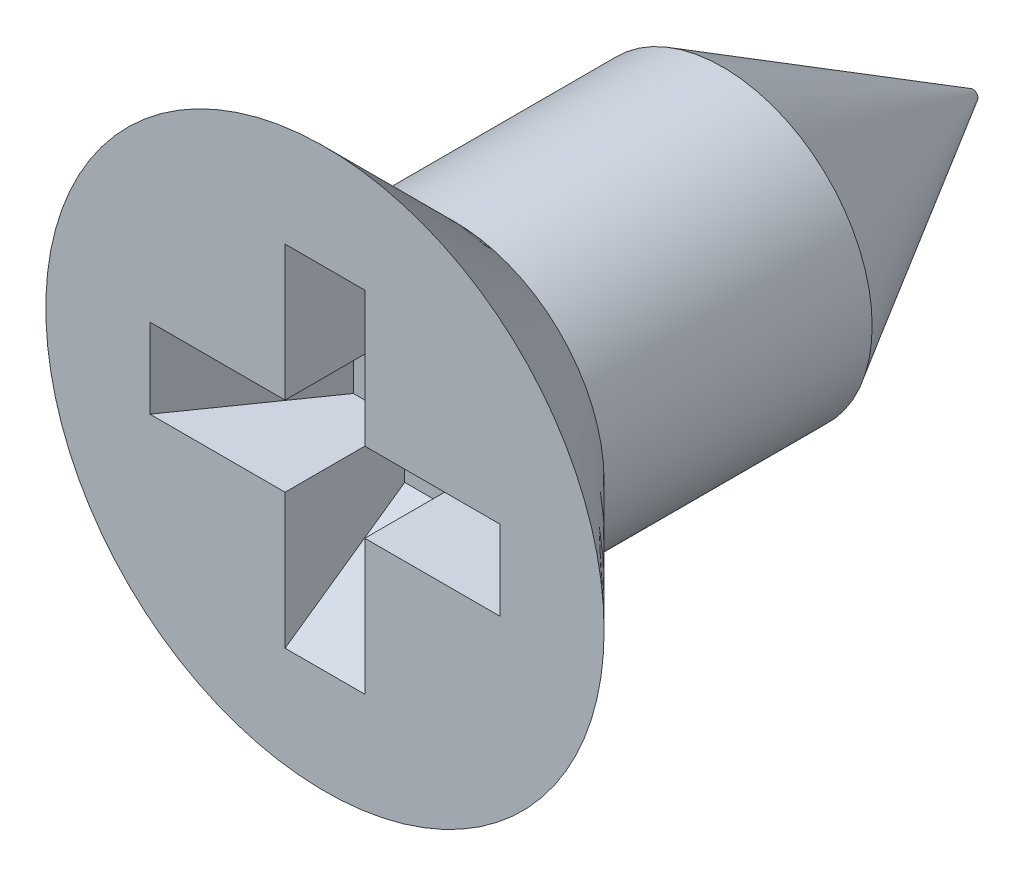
ISO-10303-21;
HEADER;
FILE_DESCRIPTION(('STEP AP214'),'2;1');
FILE_NAME('part.step','',(''),(''),'','','');
FILE_SCHEMA(('AUTOMOTIVE_DESIGN { 1 0 10303 214 1 1 1 1 }'));
ENDSEC;
DATA;
#1=APPLICATION_CONTEXT('core data for automotive mechanical design processes');
#2=APPLICATION_PROTOCOL_DEFINITION('international standard','automotive_design',2000,#1);
#3=PRODUCT_CONTEXT('',#1,'mechanical');
#4=PRODUCT('Part','Part','',(#3));
#5=PRODUCT_RELATED_PRODUCT_CATEGORY('part','',(#4));
#6=PRODUCT_DEFINITION_FORMATION('','',#4);
#7=PRODUCT_DEFINITION_CONTEXT('part definition',#1,'design');
#8=PRODUCT_DEFINITION('design','',#6,#7);
#9=PRODUCT_DEFINITION_SHAPE('','',#8);
#10=(LENGTH_UNIT() NAMED_UNIT(*) SI_UNIT(.MILLI.,.METRE.));
#11=(NAMED_UNIT(*) PLANE_ANGLE_UNIT() SI_UNIT($,.RADIAN.));
#12=(NAMED_UNIT(*) SI_UNIT($,.STERADIAN.) SOLID_ANGLE_UNIT());
#13=UNCERTAINTY_MEASURE_WITH_UNIT(LENGTH_MEASURE(1.E-05),#10,'distance_accuracy_value','');
#14=(GEOMETRIC_REPRESENTATION_CONTEXT(3) GLOBAL_UNCERTAINTY_ASSIGNED_CONTEXT((#13)) GLOBAL_UNIT_ASSIGNED_CONTEXT((#10,
#11,#12)) REPRESENTATION_CONTEXT('',''));
#15=CARTESIAN_POINT('',(0.,0.,0.));
#16=DIRECTION('',(0.,0.,1.));
#17=DIRECTION('',(1.,0.,0.));
#18=AXIS2_PLACEMENT_3D('',#15,#16,#17);
#19=CARTESIAN_POINT('',(-1.75499287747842,-0.4,0.));
#20=DIRECTION('',(0.819152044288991,0.,0.573576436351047));
#21=DIRECTION('',(0.573576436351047,0.,-0.819152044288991));
#22=AXIS2_PLACEMENT_3D('',#19,#20,#21);
#23=PLANE('',#22);
#24=DIRECTION('',(0.,1.,0.));
#25=VECTOR('',#24,1.);
#26=CARTESIAN_POINT('',(0.,0.4,-2.50638957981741));
#27=LINE('',#26,#25);
#28=CARTESIAN_POINT('',(0.,-0.29361042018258,-2.50638957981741));
#29=VERTEX_POINT('',#28);
#30=CARTESIAN_POINT('',(0.,0.,-2.50638957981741));
#31=VERTEX_POINT('',#30);
#32=EDGE_CURVE('E353',#29,#31,#27,.T.);
#33=ORIENTED_EDGE('',*,*,#32,.F.);
#34=CARTESIAN_POINT('',(0.103438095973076,-0.102874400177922,-2.65411449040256));
#35=CARTESIAN_POINT('',(0.09992365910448,-0.113485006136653,-2.64909535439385));
#36=CARTESIAN_POINT('',(0.096077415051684,-0.123726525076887,-2.64360234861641));
#37=CARTESIAN_POINT('',(0.0878958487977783,-0.143557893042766,-2.63191786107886));
#38=CARTESIAN_POINT('',(0.0835619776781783,-0.153149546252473,-2.62572845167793));
#39=CARTESIAN_POINT('',(0.0745900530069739,-0.171760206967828,-2.61291521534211));
#40=CARTESIAN_POINT('',(0.0699544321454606,-0.180782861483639,-2.60629486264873));
#41=CARTESIAN_POINT('',(0.0604348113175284,-0.198432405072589,-2.59269943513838));
#42=CARTESIAN_POINT('',(0.0555506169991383,-0.207058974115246,-2.58572408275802));
#43=CARTESIAN_POINT('',(0.0425194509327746,-0.229237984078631,-2.56711364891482));
#44=CARTESIAN_POINT('',(0.0342270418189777,-0.242528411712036,-2.55527086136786));
#45=CARTESIAN_POINT('',(0.0172728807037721,-0.268554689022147,-2.5310578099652));
#46=CARTESIAN_POINT('',(0.00860925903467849,-0.28128685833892,-2.51868487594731));
#47=CARTESIAN_POINT('',(-0.000140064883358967,-0.2938104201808,-2.50618954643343));
#48=B_SPLINE_CURVE_WITH_KNOTS('',3,(#34,#35,#36,#37,#38,#39,#40,#41,#42,#43,#44,#45,#46,#47),
.UNSPECIFIED.,.F.,.F.,(4,2,2,2,2,2,4),(0.,0.036695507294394,0.0732845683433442,
0.109608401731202,0.145961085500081,0.204852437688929,0.264086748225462),.UNSPECIFIED.);
#49=CARTESIAN_POINT('',(0.103298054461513,-0.103298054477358,-2.65391449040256));
#50=VERTEX_POINT('',#49);
#51=EDGE_CURVE('E288',#50,#29,#48,.T.);
#52=ORIENTED_EDGE('',*,*,#51,.F.);
#53=DIRECTION('',(-0.497542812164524,0.497542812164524,0.710564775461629));
#54=VECTOR('',#53,1.);
#55=CARTESIAN_POINT('',(-1.41956594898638,1.41956594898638,-0.479039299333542));
#56=LINE('',#55,#54);
#57=EDGE_CURVE('E351',#50,#31,#56,.T.);
#58=ORIENTED_EDGE('',*,*,#57,.T.);
#59=EDGE_LOOP('',(#33,#52,#58));
#60=FACE_BOUND('',#59,.T.);
#61=ADVANCED_FACE('F26',(#60),#23,.T.);
#62=DIRECTION('',(0.,1.,0.));
#63=VECTOR('',#62,1.);
#64=CARTESIAN_POINT('',(-0.91474383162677,-0.4,-1.2));
#65=LINE('',#64,#63);
#66=CARTESIAN_POINT('',(-0.91474383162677,0.4,-1.2));
#67=VERTEX_POINT('',#66);
#68=CARTESIAN_POINT('',(-0.91474383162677,-0.4,-1.2));
#69=VERTEX_POINT('',#68);
#70=EDGE_CURVE('E347',#67,#69,#65,.F.);
#71=ORIENTED_EDGE('',*,*,#70,.F.);
#72=DIRECTION('',(0.573576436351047,0.,-0.819152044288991));
#73=VECTOR('',#72,1.);
#74=CARTESIAN_POINT('',(-1.19117730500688,0.4,-0.8052120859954));
#75=LINE('',#74,#73);
#76=CARTESIAN_POINT('',(-1.75499287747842,0.4,0.));
#77=VERTEX_POINT('',#76);
#78=EDGE_CURVE('E231',#67,#77,#75,.F.);
#79=ORIENTED_EDGE('',*,*,#78,.T.);
#80=DIRECTION('',(0.,-1.,0.));
#81=VECTOR('',#80,1.);
#82=CARTESIAN_POINT('',(-1.75499287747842,-0.4,0.));
#83=LINE('',#82,#81);
#84=CARTESIAN_POINT('',(-1.75499287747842,-0.4,0.));
#85=VERTEX_POINT('',#84);
#86=EDGE_CURVE('E172',#77,#85,#83,.T.);
#87=ORIENTED_EDGE('',*,*,#86,.T.);
#88=DIRECTION('',(0.573576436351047,0.,-0.819152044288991));
#89=VECTOR('',#88,1.);
#90=CARTESIAN_POINT('',(-1.75499287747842,-0.4,0.));
#91=LINE('',#90,#89);
#92=EDGE_CURVE('E163',#69,#85,#91,.F.);
#93=ORIENTED_EDGE('',*,*,#92,.F.);
#94=EDGE_LOOP('',(#71,#79,#87,#93));
#95=FACE_BOUND('',#94,.T.);
#96=ADVANCED_FACE('F282',(#95),#23,.T.);
#97=CARTESIAN_POINT('',(0.4,-1.75499287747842,0.));
#98=DIRECTION('',(0.,0.819152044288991,0.573576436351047));
#99=DIRECTION('',(0.,-0.573576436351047,0.819152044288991));
#100=AXIS2_PLACEMENT_3D('',#97,#98,#99);
#101=PLANE('',#100);
#102=DIRECTION('',(-1.,0.,0.));
#103=VECTOR('',#102,1.);
#104=CARTESIAN_POINT('',(0.4,-0.91474383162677,-1.2));
#105=LINE('',#104,#103);
#106=CARTESIAN_POINT('',(-0.4,-0.91474383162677,-1.2));
#107=VERTEX_POINT('',#106);
#108=CARTESIAN_POINT('',(0.4,-0.91474383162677,-1.2));
#109=VERTEX_POINT('',#108);
#110=EDGE_CURVE('E345',#107,#109,#105,.F.);
#111=ORIENTED_EDGE('',*,*,#110,.F.);
#112=DIRECTION('',(0.,0.573576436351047,-0.819152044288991));
#113=VECTOR('',#112,1.);
#114=CARTESIAN_POINT('',(-0.4,-0.74539829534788,-1.44185049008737));
#115=LINE('',#114,#113);
#116=CARTESIAN_POINT('',(-0.4,-1.75499287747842,0.));
#117=VERTEX_POINT('',#116);
#118=EDGE_CURVE('E162',#107,#117,#115,.F.);
#119=ORIENTED_EDGE('',*,*,#118,.T.);
#120=DIRECTION('',(1.,0.,0.));
#121=VECTOR('',#120,1.);
#122=CARTESIAN_POINT('',(0.4,-1.75499287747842,0.));
#123=LINE('',#122,#121);
#124=CARTESIAN_POINT('',(0.4,-1.75499287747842,0.));
#125=VERTEX_POINT('',#124);
#126=EDGE_CURVE('E178',#117,#125,#123,.T.);
#127=ORIENTED_EDGE('',*,*,#126,.T.);
#128=DIRECTION('',(0.,0.573576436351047,-0.819152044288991));
#129=VECTOR('',#128,1.);
#130=CARTESIAN_POINT('',(0.4,-1.75499287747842,0.));
#131=LINE('',#130,#129);
#132=EDGE_CURVE('E239',#109,#125,#131,.F.);
#133=ORIENTED_EDGE('',*,*,#132,.F.);
#134=EDGE_LOOP('',(#111,#119,#127,#133));
#135=FACE_BOUND('',#134,.T.);
#136=ADVANCED_FACE('F278',(#135),#101,.T.);
#137=CARTESIAN_POINT('',(-1.75499287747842,1.75499287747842,-1.2));
#138=DIRECTION('',(0.,0.,-1.));
#139=DIRECTION('',(-1.,0.,0.));
#140=AXIS2_PLACEMENT_3D('',#137,#138,#139);
#141=PLANE('',#140);
#142=DIRECTION('',(0.,-1.,0.));
#143=VECTOR('',#142,1.);
#144=CARTESIAN_POINT('',(-0.4,1.75499287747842,-1.2));
#145=LINE('',#144,#143);
#146=CARTESIAN_POINT('',(-0.4,1.54919333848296,-1.2));
#147=VERTEX_POINT('',#146);
#148=CARTESIAN_POINT('',(-0.4,0.91474383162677,-1.2));
#149=VERTEX_POINT('',#148);
#150=EDGE_CURVE('E222',#147,#149,#145,.T.);
#151=ORIENTED_EDGE('',*,*,#150,.T.);
#152=CARTESIAN_POINT('',(-0.4,0.4,-1.2));
#153=VERTEX_POINT('',#152);
#154=EDGE_CURVE('E223',#149,#153,#145,.T.);
#155=ORIENTED_EDGE('',*,*,#154,.T.);
#156=DIRECTION('',(-1.,0.,0.));
#157=VECTOR('',#156,1.);
#158=CARTESIAN_POINT('',(-1.75499287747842,0.4,-1.2));
#159=LINE('',#158,#157);
#160=EDGE_CURVE('E226',#153,#67,#159,.T.);
#161=ORIENTED_EDGE('',*,*,#160,.T.);
#162=ORIENTED_EDGE('',*,*,#70,.T.);
#163=DIRECTION('',(1.,0.,0.));
#164=VECTOR('',#163,1.);
#165=CARTESIAN_POINT('',(-1.75499287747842,-0.4,-1.2));
#166=LINE('',#165,#164);
#167=CARTESIAN_POINT('',(-0.4,-0.4,-1.2));
#168=VERTEX_POINT('',#167);
#169=EDGE_CURVE('E207',#69,#168,#166,.T.);
#170=ORIENTED_EDGE('',*,*,#169,.T.);
#171=DIRECTION('',(0.,-1.,0.));
#172=VECTOR('',#171,1.);
#173=CARTESIAN_POINT('',(-0.4,-0.4,-1.2));
#174=LINE('',#173,#172);
#175=EDGE_CURVE('E158',#168,#107,#174,.T.);
#176=ORIENTED_EDGE('',*,*,#175,.T.);
#177=ORIENTED_EDGE('',*,*,#110,.T.);
#178=DIRECTION('',(0.,1.,0.));
#179=VECTOR('',#178,1.);
#180=CARTESIAN_POINT('',(0.4,-0.4,-1.2));
#181=LINE('',#180,#179);
#182=CARTESIAN_POINT('',(0.4,-0.4,-1.2));
#183=VERTEX_POINT('',#182);
#184=EDGE_CURVE('E210',#109,#183,#181,.T.);
#185=ORIENTED_EDGE('',*,*,#184,.T.);
#186=DIRECTION('',(1.,0.,0.));
#187=VECTOR('',#186,1.);
#188=CARTESIAN_POINT('',(0.4,-0.4,-1.2));
#189=LINE('',#188,#187);
#190=CARTESIAN_POINT('',(0.91474383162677,-0.4,-1.2));
#191=VERTEX_POINT('',#190);
#192=EDGE_CURVE('E213',#183,#191,#189,.T.);
#193=ORIENTED_EDGE('',*,*,#192,.T.);
#194=DIRECTION('',(0.,-1.,0.));
#195=VECTOR('',#194,1.);
#196=CARTESIAN_POINT('',(0.91474383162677,0.4,-1.2));
#197=LINE('',#196,#195);
#198=CARTESIAN_POINT('',(0.91474383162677,0.4,-1.2));
#199=VERTEX_POINT('',#198);
#200=EDGE_CURVE('E338',#191,#199,#197,.F.);
#201=ORIENTED_EDGE('',*,*,#200,.T.);
#202=DIRECTION('',(-1.,0.,0.));
#203=VECTOR('',#202,1.);
#204=CARTESIAN_POINT('',(0.4,0.4,-1.2));
#205=LINE('',#204,#203);
#206=CARTESIAN_POINT('',(0.4,0.4,-1.2));
#207=VERTEX_POINT('',#206);
#208=EDGE_CURVE('E216',#199,#207,#205,.T.);
#209=ORIENTED_EDGE('',*,*,#208,.T.);
#210=DIRECTION('',(0.,1.,0.));
#211=VECTOR('',#210,1.);
#212=CARTESIAN_POINT('',(0.4,1.75499287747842,-1.2));
#213=LINE('',#212,#211);
#214=CARTESIAN_POINT('',(0.4,0.91474383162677,-1.2));
#215=VERTEX_POINT('',#214);
#216=EDGE_CURVE('E219',#207,#215,#213,.T.);
#217=ORIENTED_EDGE('',*,*,#216,.T.);
#218=CARTESIAN_POINT('',(0.4,1.54919333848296,-1.2));
#219=VERTEX_POINT('',#218);
#220=EDGE_CURVE('E220',#215,#219,#213,.T.);
#221=ORIENTED_EDGE('',*,*,#220,.T.);
#222=CARTESIAN_POINT('',(0.,0.,-1.2));
#223=DIRECTION('',(0.,0.,-1.));
#224=DIRECTION('',(-1.,0.,0.));
#225=AXIS2_PLACEMENT_3D('',#222,#223,#224);
#226=CIRCLE('',#225,1.6);
#227=EDGE_CURVE('E248',#147,#219,#226,.T.);
#228=ORIENTED_EDGE('',*,*,#227,.F.);
#229=EDGE_LOOP('',(#151,#155,#161,#162,#170,#176,#177,#185,#193,#201,#209,#217,#221,#228));
#230=FACE_BOUND('',#229,.T.);
#231=ADVANCED_FACE('F281',(#230),#141,.F.);
#232=CARTESIAN_POINT('',(1.75499287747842,0.4,0.));
#233=DIRECTION('',(-0.819152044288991,0.,0.573576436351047));
#234=DIRECTION('',(0.573576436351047,0.,0.819152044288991));
#235=AXIS2_PLACEMENT_3D('',#232,#233,#234);
#236=PLANE('',#235);
#237=ORIENTED_EDGE('',*,*,#200,.F.);
#238=DIRECTION('',(-0.573576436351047,0.,-0.819152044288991));
#239=VECTOR('',#238,1.);
#240=CARTESIAN_POINT('',(0.74539829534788,-0.4,-1.44185049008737));
#241=LINE('',#240,#239);
#242=CARTESIAN_POINT('',(1.75499287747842,-0.4,0.));
#243=VERTEX_POINT('',#242);
#244=EDGE_CURVE('E238',#191,#243,#241,.F.);
#245=ORIENTED_EDGE('',*,*,#244,.T.);
#246=DIRECTION('',(0.,1.,0.));
#247=VECTOR('',#246,1.);
#248=CARTESIAN_POINT('',(1.75499287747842,0.4,0.));
#249=LINE('',#248,#247);
#250=CARTESIAN_POINT('',(1.75499287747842,0.4,0.));
#251=VERTEX_POINT('',#250);
#252=EDGE_CURVE('E189',#243,#251,#249,.T.);
#253=ORIENTED_EDGE('',*,*,#252,.T.);
#254=DIRECTION('',(-0.573576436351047,0.,-0.819152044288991));
#255=VECTOR('',#254,1.);
#256=CARTESIAN_POINT('',(1.75499287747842,0.4,0.));
#257=LINE('',#256,#255);
#258=EDGE_CURVE('E236',#199,#251,#257,.F.);
#259=ORIENTED_EDGE('',*,*,#258,.F.);
#260=EDGE_LOOP('',(#237,#245,#253,#259));
#261=FACE_BOUND('',#260,.T.);
#262=ADVANCED_FACE('F317',(#261),#236,.T.);
#263=CARTESIAN_POINT('',(-0.4,1.75499287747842,-1.2));
#264=DIRECTION('',(-1.,0.,0.));
#265=DIRECTION('',(0.,-1.,0.));
#266=AXIS2_PLACEMENT_3D('',#263,#264,#265);
#267=PLANE('',#266);
#268=DIRECTION('',(0.,-0.573576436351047,-0.819152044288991));
#269=VECTOR('',#268,1.);
#270=CARTESIAN_POINT('',(-0.4,1.75499287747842,0.));
#271=LINE('',#270,#269);
#272=CARTESIAN_POINT('',(-0.399999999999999,0.0800481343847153,-2.39206899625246));
#273=VERTEX_POINT('',#272);
#274=EDGE_CURVE('E232',#273,#149,#271,.F.);
#275=ORIENTED_EDGE('',*,*,#274,.T.);
#276=ORIENTED_EDGE('',*,*,#150,.F.);
#277=CARTESIAN_POINT('',(-0.399999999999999,15.0579581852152,12.2632700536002));
#278=CARTESIAN_POINT('',(-0.399999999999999,14.5558054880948,11.7612956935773));
#279=CARTESIAN_POINT('',(-0.399999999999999,14.0536451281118,11.2593289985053));
#280=CARTESIAN_POINT('',(-0.399999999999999,13.0492997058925,10.2554201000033));
#281=CARTESIAN_POINT('',(-0.399999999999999,12.5471146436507,9.75347789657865));
#282=CARTESIAN_POINT('',(-0.4,11.5427035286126,8.74962023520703));
#283=CARTESIAN_POINT('',(-0.4,11.0404774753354,8.24770477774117));
#284=CARTESIAN_POINT('',(-0.4,10.035974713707,7.24392476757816));
#285=CARTESIAN_POINT('',(-0.4,9.53369800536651,6.74206021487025));
#286=CARTESIAN_POINT('',(-0.4,8.53379190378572,5.74313239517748));
#287=CARTESIAN_POINT('',(-0.4,8.03616325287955,5.24606838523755));
#288=CARTESIAN_POINT('',(-0.4,7.04077073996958,4.25207516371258));
#289=CARTESIAN_POINT('',(-0.4,6.54300687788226,3.75514595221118));
#290=CARTESIAN_POINT('',(-0.4,5.54723950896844,2.76153914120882));
#291=CARTESIAN_POINT('',(-0.4,5.04923600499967,2.26486153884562));
#292=CARTESIAN_POINT('',(-0.4,4.30178667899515,1.52029138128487));
#293=CARTESIAN_POINT('',(-0.4,4.05256301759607,1.27217582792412));
#294=CARTESIAN_POINT('',(-0.4,3.55386033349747,0.776201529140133));
#295=CARTESIAN_POINT('',(-0.4,3.30438131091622,0.528342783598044));
#296=CARTESIAN_POINT('',(-0.4,2.93753545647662,0.164606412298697));
#297=CARTESIAN_POINT('',(-0.4,2.82036145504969,0.0485343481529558));
#298=CARTESIAN_POINT('',(-0.4,2.58585174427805,-0.183450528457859));
#299=CARTESIAN_POINT('',(-0.4,2.46851603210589,-0.299363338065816));
#300=CARTESIAN_POINT('',(-0.4,2.23338081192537,-0.531167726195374));
#301=CARTESIAN_POINT('',(-0.4,2.11558084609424,-0.647058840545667));
#302=CARTESIAN_POINT('',(-0.4,1.8796050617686,-0.878446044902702));
#303=CARTESIAN_POINT('',(-0.4,1.76142926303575,-0.993942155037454));
#304=CARTESIAN_POINT('',(-0.4,1.56017330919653,-1.18948487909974));
#305=CARTESIAN_POINT('',(-0.4,1.47726626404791,-1.26970931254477));
#306=CARTESIAN_POINT('',(-0.4,1.3109062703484,-1.42961730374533));
#307=CARTESIAN_POINT('',(-0.4,1.22745323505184,-1.5093007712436));
#308=CARTESIAN_POINT('',(-0.4,1.05990662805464,-1.66747507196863));
#309=CARTESIAN_POINT('',(-0.4,0.975815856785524,-1.74596884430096));
#310=CARTESIAN_POINT('',(-0.4,0.848350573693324,-1.8622334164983));
#311=CARTESIAN_POINT('',(-0.4,0.805646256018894,-1.9007373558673));
#312=CARTESIAN_POINT('',(-0.4,0.719561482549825,-1.97697966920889));
#313=CARTESIAN_POINT('',(-0.4,0.676181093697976,-2.01471811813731));
#314=CARTESIAN_POINT('',(-0.4,0.592876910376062,-2.08511456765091));
#315=CARTESIAN_POINT('',(-0.4,0.553057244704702,-2.11789551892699));
#316=CARTESIAN_POINT('',(-0.4,0.471811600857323,-2.18196758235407));
#317=CARTESIAN_POINT('',(-0.4,0.430377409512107,-2.21324856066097));
#318=CARTESIAN_POINT('',(-0.4,0.366190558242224,-2.25791062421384));
#319=CARTESIAN_POINT('',(-0.4,0.344296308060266,-2.27251479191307));
#320=CARTESIAN_POINT('',(-0.4,0.299692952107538,-2.30048853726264));
#321=CARTESIAN_POINT('',(-0.4,0.276983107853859,-2.31385695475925));
#322=CARTESIAN_POINT('',(-0.4,0.230746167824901,-2.33862577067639));
#323=CARTESIAN_POINT('',(-0.4,0.207227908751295,-2.35004229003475));
#324=CARTESIAN_POINT('',(-0.4,0.159057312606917,-2.37009132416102));
#325=CARTESIAN_POINT('',(-0.4,0.134407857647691,-2.37873050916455));
#326=CARTESIAN_POINT('',(-0.4,0.0836001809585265,-2.3920966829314));
#327=CARTESIAN_POINT('',(-0.4,0.0574247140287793,-2.39676217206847));
#328=CARTESIAN_POINT('',(-0.4,0.0047203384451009,-2.4008277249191));
#329=CARTESIAN_POINT('',(-0.4,-0.0218072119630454,-2.40024417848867));
#330=CARTESIAN_POINT('',(-0.4,-0.0740664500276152,-2.394031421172));
#331=CARTESIAN_POINT('',(-0.4,-0.0998019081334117,-2.38843198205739));
#332=CARTESIAN_POINT('',(-0.4,-0.137559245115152,-2.37718134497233));
#333=CARTESIAN_POINT('',(-0.4,-0.150037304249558,-2.37294020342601));
#334=CARTESIAN_POINT('',(-0.4,-0.174694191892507,-2.36366501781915));
#335=CARTESIAN_POINT('',(-0.4,-0.186873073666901,-2.35863111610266));
#336=CARTESIAN_POINT('',(-0.4,-0.221460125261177,-2.34323447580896));
#337=CARTESIAN_POINT('',(-0.4,-0.243504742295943,-2.33205986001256));
#338=CARTESIAN_POINT('',(-0.4,-0.28674808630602,-2.30816513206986));
#339=CARTESIAN_POINT('',(-0.4,-0.307945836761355,-2.2954433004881));
#340=CARTESIAN_POINT('',(-0.4,-0.370676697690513,-2.25562796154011));
#341=CARTESIAN_POINT('',(-0.4,-0.411199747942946,-2.22695881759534));
#342=CARTESIAN_POINT('',(-0.4,-0.491046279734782,-2.16720199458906));
#343=CARTESIAN_POINT('',(-0.4,-0.530352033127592,-2.13609149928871));
#344=CARTESIAN_POINT('',(-0.4,-0.607844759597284,-2.07268891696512));
#345=CARTESIAN_POINT('',(-0.4,-0.646034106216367,-2.04039972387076));
#346=CARTESIAN_POINT('',(-0.4,-0.720929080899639,-1.97574798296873));
#347=CARTESIAN_POINT('',(-0.4,-0.757648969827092,-1.94340180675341));
#348=CARTESIAN_POINT('',(-0.4,-0.830642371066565,-1.8782086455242));
#349=CARTESIAN_POINT('',(-0.4,-0.866915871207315,-1.84536164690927));
#350=CARTESIAN_POINT('',(-0.4,-0.97527461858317,-1.74629556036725));
#351=CARTESIAN_POINT('',(-0.4,-1.04688735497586,-1.67956084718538));
#352=CARTESIAN_POINT('',(-0.4,-1.1894988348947,-1.54527111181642));
#353=CARTESIAN_POINT('',(-0.4,-1.26049672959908,-1.47771519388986));
#354=CARTESIAN_POINT('',(-0.4,-1.40204788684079,-1.34215102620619));
#355=CARTESIAN_POINT('',(-0.4,-1.47260118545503,-1.27414281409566));
#356=CARTESIAN_POINT('',(-0.4,-1.61263010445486,-1.1385931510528));
#357=CARTESIAN_POINT('',(-0.4,-1.68210893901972,-1.07105501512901));
#358=CARTESIAN_POINT('',(-0.4,-1.82087103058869,-0.935775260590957));
#359=CARTESIAN_POINT('',(-0.4,-1.89015428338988,-0.868033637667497));
#360=CARTESIAN_POINT('',(-0.4,-2.09772182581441,-0.664662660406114));
#361=CARTESIAN_POINT('',(-0.4,-2.23579508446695,-0.528818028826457));
#362=CARTESIAN_POINT('',(-0.4,-2.64691525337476,-0.123422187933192));
#363=CARTESIAN_POINT('',(-0.4,-2.9195143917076,0.146582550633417));
#364=CARTESIAN_POINT('',(-0.4,-3.46422315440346,0.687087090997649));
#365=CARTESIAN_POINT('',(-0.4,-3.73633277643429,0.957586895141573));
#366=CARTESIAN_POINT('',(-0.4,-4.28035165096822,1.4989153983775));
#367=CARTESIAN_POINT('',(-0.4,-4.55226084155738,1.76974415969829));
#368=CARTESIAN_POINT('',(-0.4,-5.09592685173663,2.31155357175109));
#369=CARTESIAN_POINT('',(-0.4,-5.3676836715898,2.58253422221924));
#370=CARTESIAN_POINT('',(-0.4,-6.19795427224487,3.41071951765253));
#371=CARTESIAN_POINT('',(-0.4,-6.75631703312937,3.96807555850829));
#372=CARTESIAN_POINT('',(-0.4,-7.59365945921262,4.80417361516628));
#373=CARTESIAN_POINT('',(-0.4,-7.87270550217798,5.08284918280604));
#374=CARTESIAN_POINT('',(-0.4,-8.43076267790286,5.64023492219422));
#375=CARTESIAN_POINT('',(-0.4,-8.70977381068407,5.91894509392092));
#376=CARTESIAN_POINT('',(-0.4,-8.98877231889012,6.19766790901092));
#377=B_SPLINE_CURVE_WITH_KNOTS('',3,(#277,#278,#279,#280,#281,#282,#283,#284,#285,#286,#287,
#288,#289,#290,#291,#292,#293,#294,#295,#296,#297,#298,#299,#300,#301,#302,#303,#304,#305,#306,
#307,#308,#309,#310,#311,#312,#313,#314,#315,#316,#317,#318,#319,#320,#321,#322,#323,#324,#325,
#326,#327,#328,#329,#330,#331,#332,#333,#334,#335,#336,#337,#338,#339,#340,#341,#342,#343,#344,
#345,#346,#347,#348,#349,#350,#351,#352,#353,#354,#355,#356,#357,#358,#359,#360,#361,#362,#363,
#364,#365,#366,#367,#368,#369,#370,#371,#372,#373,#374,#375,#376),.UNSPECIFIED.,.F.,.F.,(4,2,2,
2,2,2,2,2,2,2,2,2,2,2,2,2,2,2,2,2,2,2,2,2,2,2,2,2,2,2,2,2,2,2,2,2,2,2,2,2,2,2,2,2,2,2,2,2,2,4),
(0.,2.13007518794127,4.26015084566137,6.39025675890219,8.5203622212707,10.630424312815,
12.7404877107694,14.8505265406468,15.905544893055,16.9605627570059,17.4553578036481,
17.9501616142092,18.4459113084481,18.9416353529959,19.2877342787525,19.6338895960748,
19.9789680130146,20.1514624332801,20.3239398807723,20.4786541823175,20.6342979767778,
20.7132243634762,20.7922241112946,20.8705360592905,20.9486584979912,21.0279691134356,
21.1070321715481,21.1856290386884,21.2251461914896,21.2646562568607,21.3387009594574,
21.412828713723,21.5615772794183,21.7119356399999,21.8619468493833,22.0087463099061,
22.1555497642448,22.4491996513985,22.7432052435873,23.0371866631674,23.3278722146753,
23.6185639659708,24.1996497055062,25.3506976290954,26.5017510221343,27.6530742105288,
28.8043954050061,31.1711932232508,32.3542996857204,33.5374054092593),.UNSPECIFIED.);
#378=CARTESIAN_POINT('',(-0.4,1.4456832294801,-1.3));
#379=VERTEX_POINT('',#378);
#380=EDGE_CURVE('E265',#379,#147,#377,.F.);
#381=ORIENTED_EDGE('',*,*,#380,.F.);
#382=EDGE_CURVE('E332',#273,#379,#377,.F.);
#383=ORIENTED_EDGE('',*,*,#382,.F.);
#384=EDGE_LOOP('',(#275,#276,#381,#383));
#385=FACE_BOUND('',#384,.T.);
#386=ADVANCED_FACE('F328',(#385),#267,.T.);
#387=CARTESIAN_POINT('',(0.4,1.75499287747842,-1.2));
#388=DIRECTION('',(1.,0.,0.));
#389=DIRECTION('',(0.,0.,-1.));
#390=AXIS2_PLACEMENT_3D('',#387,#388,#389);
#391=PLANE('',#390);
#392=ORIENTED_EDGE('',*,*,#220,.F.);
#393=DIRECTION('',(0.,-0.573576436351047,-0.819152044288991));
#394=VECTOR('',#393,1.);
#395=CARTESIAN_POINT('',(0.4,1.19117730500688,-0.8052120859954));
#396=LINE('',#395,#394);
#397=CARTESIAN_POINT('',(0.4,0.080048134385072,-2.39206899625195));
#398=VERTEX_POINT('',#397);
#399=EDGE_CURVE('E235',#398,#215,#396,.F.);
#400=ORIENTED_EDGE('',*,*,#399,.F.);
#401=CARTESIAN_POINT('',(0.4,-8.98877231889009,6.19766790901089));
#402=CARTESIAN_POINT('',(0.4,-8.67677785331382,5.88598452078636));
#403=CARTESIAN_POINT('',(0.4,-8.36476980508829,5.57431472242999));
#404=CARTESIAN_POINT('',(0.4,-7.74070720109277,4.95101906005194));
#405=CARTESIAN_POINT('',(0.4,-7.42865264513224,4.63939319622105));
#406=CARTESIAN_POINT('',(0.4,-6.80445030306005,4.01617482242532));
#407=CARTESIAN_POINT('',(0.4,-6.49230251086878,3.70458231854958));
#408=CARTESIAN_POINT('',(0.4,-5.86791216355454,3.08149481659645));
#409=CARTESIAN_POINT('',(0.4,-5.55566960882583,2.76999981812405));
#410=CARTESIAN_POINT('',(0.4,-4.93358205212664,2.14971502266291));
#411=CARTESIAN_POINT('',(0.4,-4.6237383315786,1.84092394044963));
#412=CARTESIAN_POINT('',(0.4,-4.00378028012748,1.22360590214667));
#413=CARTESIAN_POINT('',(0.4,-3.69366594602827,0.915078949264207));
#414=CARTESIAN_POINT('',(0.4,-3.2280826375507,0.452721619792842));
#415=CARTESIAN_POINT('',(0.4,-3.07282418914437,0.298679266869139));
#416=CARTESIAN_POINT('',(0.4,-2.76208514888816,-0.00918294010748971));
#417=CARTESIAN_POINT('',(0.4,-2.60660455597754,-0.163002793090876));
#418=CARTESIAN_POINT('',(0.4,-2.2952766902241,-0.47026389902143));
#419=CARTESIAN_POINT('',(0.4,-2.13942942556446,-0.623705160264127));
#420=CARTESIAN_POINT('',(0.4,-1.82707739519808,-0.929916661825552));
#421=CARTESIAN_POINT('',(0.4,-1.67057263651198,-1.08268690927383));
#422=CARTESIAN_POINT('',(0.4,-1.4712876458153,-1.27534266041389));
#423=CARTESIAN_POINT('',(0.4,-1.42919052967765,-1.31593419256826));
#424=CARTESIAN_POINT('',(0.4,-1.34485413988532,-1.39696971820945));
#425=CARTESIAN_POINT('',(0.4,-1.30261486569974,-1.43741371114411));
#426=CARTESIAN_POINT('',(0.4,-1.21790078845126,-1.51815834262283));
#427=CARTESIAN_POINT('',(0.4,-1.17542576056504,-1.5584587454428));
#428=CARTESIAN_POINT('',(0.4,-1.09022739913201,-1.63879610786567));
#429=CARTESIAN_POINT('',(0.4,-1.04750406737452,-1.67883306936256));
#430=CARTESIAN_POINT('',(0.4,-0.946477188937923,-1.77269586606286));
#431=CARTESIAN_POINT('',(0.4,-0.888030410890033,-1.82636758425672));
#432=CARTESIAN_POINT('',(0.4,-0.770250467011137,-1.93246551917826));
#433=CARTESIAN_POINT('',(0.4,-0.710919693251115,-1.98489435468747));
#434=CARTESIAN_POINT('',(0.4,-0.609163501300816,-2.07156587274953));
#435=CARTESIAN_POINT('',(0.4,-0.567230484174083,-2.10638522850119));
#436=CARTESIAN_POINT('',(0.4,-0.481616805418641,-2.17449372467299));
#437=CARTESIAN_POINT('',(0.4,-0.437925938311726,-2.20777040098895));
#438=CARTESIAN_POINT('',(0.4,-0.370106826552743,-2.25527989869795));
#439=CARTESIAN_POINT('',(0.4,-0.346914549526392,-2.2708361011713));
#440=CARTESIAN_POINT('',(0.4,-0.299611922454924,-2.30057434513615));
#441=CARTESIAN_POINT('',(0.4,-0.275500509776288,-2.31475472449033));
#442=CARTESIAN_POINT('',(0.4,-0.226415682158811,-2.34083021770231));
#443=CARTESIAN_POINT('',(0.4,-0.201456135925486,-2.35275078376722));
#444=CARTESIAN_POINT('',(0.4,-0.150247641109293,-2.37335246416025));
#445=CARTESIAN_POINT('',(0.4,-0.124002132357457,-2.3820417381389));
#446=CARTESIAN_POINT('',(0.4,-0.0712736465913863,-2.39447099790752));
#447=CARTESIAN_POINT('',(0.4,-0.0448320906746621,-2.39837555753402));
#448=CARTESIAN_POINT('',(0.4,0.00826983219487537,-2.40078938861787));
#449=CARTESIAN_POINT('',(0.4,0.0349297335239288,-2.39930811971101));
#450=CARTESIAN_POINT('',(0.4,0.0872151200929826,-2.39142094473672));
#451=CARTESIAN_POINT('',(0.4,0.112847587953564,-2.38505800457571));
#452=CARTESIAN_POINT('',(0.4,0.162996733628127,-2.36872094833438));
#453=CARTESIAN_POINT('',(0.4,0.187507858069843,-2.35873067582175));
#454=CARTESIAN_POINT('',(0.4,0.250211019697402,-2.32944881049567));
#455=CARTESIAN_POINT('',(0.4,0.287474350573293,-2.30822859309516));
#456=CARTESIAN_POINT('',(0.4,0.36001468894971,-2.26257652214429));
#457=CARTESIAN_POINT('',(0.4,0.395285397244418,-2.23813521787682));
#458=CARTESIAN_POINT('',(0.4,0.464698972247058,-2.18731247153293));
#459=CARTESIAN_POINT('',(0.4,0.498834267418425,-2.16092076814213));
#460=CARTESIAN_POINT('',(0.4,0.566167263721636,-2.10707763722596));
#461=CARTESIAN_POINT('',(0.4,0.599366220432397,-2.07962775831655));
#462=CARTESIAN_POINT('',(0.4,0.688211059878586,-2.00455725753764));
#463=CARTESIAN_POINT('',(0.4,0.743294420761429,-1.95627354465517));
#464=CARTESIAN_POINT('',(0.4,0.852521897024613,-1.85861308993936));
#465=CARTESIAN_POINT('',(0.4,0.906665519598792,-1.80923580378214));
#466=CARTESIAN_POINT('',(0.4,1.0141200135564,-1.71003906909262));
#467=CARTESIAN_POINT('',(0.4,1.06743344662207,-1.66022239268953));
#468=CARTESIAN_POINT('',(0.4,1.17366653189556,-1.56017068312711));
#469=CARTESIAN_POINT('',(0.4,1.22658617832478,-1.50993564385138));
#470=CARTESIAN_POINT('',(0.4,1.34022302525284,-1.40147670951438));
#471=CARTESIAN_POINT('',(0.4,1.40089527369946,-1.34320575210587));
#472=CARTESIAN_POINT('',(0.4,1.52204643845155,-1.22635067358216));
#473=CARTESIAN_POINT('',(0.4,1.58252512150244,-1.16776631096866));
#474=CARTESIAN_POINT('',(0.4,1.76134257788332,-0.994028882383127));
#475=CARTESIAN_POINT('',(0.4,1.87943072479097,-0.878617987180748));
#476=CARTESIAN_POINT('',(0.4,2.11522557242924,-0.647406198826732));
#477=CARTESIAN_POINT('',(0.4,2.2329322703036,-0.531605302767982));
#478=CARTESIAN_POINT('',(0.4,2.58561472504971,-0.18393263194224));
#479=CARTESIAN_POINT('',(0.4,2.82024009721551,0.0482944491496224));
#480=CARTESIAN_POINT('',(0.4,3.26821543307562,0.492493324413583));
#481=CARTESIAN_POINT('',(0.4,3.48160116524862,0.704429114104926));
#482=CARTESIAN_POINT('',(0.4,3.90816301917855,1.12851207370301));
#483=CARTESIAN_POINT('',(0.4,4.12133914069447,1.34065924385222));
#484=CARTESIAN_POINT('',(0.4,4.76075243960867,1.97736484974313));
#485=CARTESIAN_POINT('',(0.4,5.18680015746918,2.40211347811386));
#486=CARTESIAN_POINT('',(0.4,6.40063874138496,3.61287974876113));
#487=CARTESIAN_POINT('',(0.4,7.18816227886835,4.39916530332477));
#488=CARTESIAN_POINT('',(0.4,8.76295040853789,5.97199608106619));
#489=CARTESIAN_POINT('',(0.4,9.55021500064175,6.75854130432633));
#490=CARTESIAN_POINT('',(0.4,11.1242654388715,8.33141136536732));
#491=CARTESIAN_POINT('',(0.4,11.9110513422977,9.1177361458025));
#492=CARTESIAN_POINT('',(0.4,13.4845477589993,10.6904604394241));
#493=CARTESIAN_POINT('',(0.4,14.2712582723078,11.4768599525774));
#494=CARTESIAN_POINT('',(0.4,15.0579581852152,12.2632700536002));
#495=B_SPLINE_CURVE_WITH_KNOTS('',3,(#401,#402,#403,#404,#405,#406,#407,#408,#409,#410,#411,
#412,#413,#414,#415,#416,#417,#418,#419,#420,#421,#422,#423,#424,#425,#426,#427,#428,#429,#430,
#431,#432,#433,#434,#435,#436,#437,#438,#439,#440,#441,#442,#443,#444,#445,#446,#447,#448,#449,
#450,#451,#452,#453,#454,#455,#456,#457,#458,#459,#460,#461,#462,#463,#464,#465,#466,#467,#468,
#469,#470,#471,#472,#473,#474,#475,#476,#477,#478,#479,#480,#481,#482,#483,#484,#485,#486,#487,
#488,#489,#490,#491,#492,#493,#494),.UNSPECIFIED.,.F.,.F.,(4,2,2,2,2,2,2,2,2,2,2,2,2,2,2,2,2,2,
2,2,2,2,2,2,2,2,2,2,2,2,2,2,2,2,2,2,2,2,2,2,2,2,2,2,2,2,4),(0.,1.3230206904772,2.64604695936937,
3.96920045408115,5.29234851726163,6.60467298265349,7.91701316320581,8.57314423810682,
9.22927845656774,9.88539816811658,10.5415108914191,10.7169488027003,10.8923873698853,
11.0680404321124,11.2436922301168,11.4817424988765,11.7192361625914,11.8827337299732,
12.0473795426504,12.1311266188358,12.2149736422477,12.2978114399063,12.3804386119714,
12.4601358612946,12.5396931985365,12.6185582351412,12.6977789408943,12.8260633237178,
12.9547328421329,13.0841355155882,13.2133555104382,13.4330718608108,13.6529001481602,
13.8717938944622,14.0906908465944,14.3430576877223,14.5956600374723,15.091016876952,
15.5863774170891,16.5767323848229,17.4789808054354,18.3812302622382,20.1860437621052,
23.5245978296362,26.8631529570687,30.2002247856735,33.5372951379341),.UNSPECIFIED.);
#496=CARTESIAN_POINT('',(0.4,1.4456832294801,-1.3));
#497=VERTEX_POINT('',#496);
#498=EDGE_CURVE('E251',#497,#398,#495,.F.);
#499=ORIENTED_EDGE('',*,*,#498,.F.);
#500=EDGE_CURVE('E339',#219,#497,#495,.F.);
#501=ORIENTED_EDGE('',*,*,#500,.F.);
#502=EDGE_LOOP('',(#392,#400,#499,#501));
#503=FACE_BOUND('',#502,.T.);
#504=ADVANCED_FACE('F377',(#503),#391,.T.);
#505=CARTESIAN_POINT('',(0.,0.,-1.3));
#506=DIRECTION('',(0.,0.,1.));
#507=DIRECTION('',(1.,0.,0.));
#508=AXIS2_PLACEMENT_3D('',#505,#506,#507);
#509=CONICAL_SURFACE('',#508,1.5,0.78539816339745);
#510=CARTESIAN_POINT('',(0.,0.,-1.3));
#511=DIRECTION('',(0.,0.,1.));
#512=DIRECTION('',(1.,0.,0.));
#513=AXIS2_PLACEMENT_3D('',#510,#511,#512);
#514=CIRCLE('',#513,1.5);
#515=EDGE_CURVE('E241',#497,#379,#514,.T.);
#516=ORIENTED_EDGE('',*,*,#515,.T.);
#517=ORIENTED_EDGE('',*,*,#380,.T.);
#518=ORIENTED_EDGE('',*,*,#227,.T.);
#519=ORIENTED_EDGE('',*,*,#500,.T.);
#520=EDGE_LOOP('',(#516,#517,#518,#519));
#521=FACE_BOUND('',#520,.T.);
#522=ADVANCED_FACE('F426',(#521),#509,.T.);
#523=CARTESIAN_POINT('',(0.,2.8,0.));
#524=DIRECTION('',(0.,0.,-1.));
#525=DIRECTION('',(-1.,0.,0.));
#526=AXIS2_PLACEMENT_3D('',#523,#524,#525);
#527=PLANE('',#526);
#528=DIRECTION('',(1.,0.,0.));
#529=VECTOR('',#528,1.);
#530=CARTESIAN_POINT('',(-1.75499287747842,-0.4,0.));
#531=LINE('',#530,#529);
#532=CARTESIAN_POINT('',(-0.4,-0.4,0.));
#533=VERTEX_POINT('',#532);
#534=EDGE_CURVE('E166',#85,#533,#531,.T.);
#535=ORIENTED_EDGE('',*,*,#534,.F.);
#536=ORIENTED_EDGE('',*,*,#86,.F.);
#537=DIRECTION('',(-1.,0.,0.));
#538=VECTOR('',#537,1.);
#539=CARTESIAN_POINT('',(-1.75499287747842,0.4,0.));
#540=LINE('',#539,#538);
#541=CARTESIAN_POINT('',(-0.4,0.4,0.));
#542=VERTEX_POINT('',#541);
#543=EDGE_CURVE('E204',#542,#77,#540,.T.);
#544=ORIENTED_EDGE('',*,*,#543,.F.);
#545=DIRECTION('',(0.,-1.,0.));
#546=VECTOR('',#545,1.);
#547=CARTESIAN_POINT('',(-0.4,1.75499287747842,0.));
#548=LINE('',#547,#546);
#549=CARTESIAN_POINT('',(-0.4,1.75499287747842,0.));
#550=VERTEX_POINT('',#549);
#551=EDGE_CURVE('E201',#550,#542,#548,.T.);
#552=ORIENTED_EDGE('',*,*,#551,.F.);
#553=DIRECTION('',(-1.,0.,0.));
#554=VECTOR('',#553,1.);
#555=CARTESIAN_POINT('',(-0.4,1.75499287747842,0.));
#556=LINE('',#555,#554);
#557=CARTESIAN_POINT('',(0.4,1.75499287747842,0.));
#558=VERTEX_POINT('',#557);
#559=EDGE_CURVE('E198',#558,#550,#556,.T.);
#560=ORIENTED_EDGE('',*,*,#559,.F.);
#561=DIRECTION('',(0.,1.,0.));
#562=VECTOR('',#561,1.);
#563=CARTESIAN_POINT('',(0.4,1.75499287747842,0.));
#564=LINE('',#563,#562);
#565=CARTESIAN_POINT('',(0.4,0.4,0.));
#566=VERTEX_POINT('',#565);
#567=EDGE_CURVE('E195',#566,#558,#564,.T.);
#568=ORIENTED_EDGE('',*,*,#567,.F.);
#569=DIRECTION('',(-1.,0.,0.));
#570=VECTOR('',#569,1.);
#571=CARTESIAN_POINT('',(0.4,0.4,0.));
#572=LINE('',#571,#570);
#573=EDGE_CURVE('E192',#251,#566,#572,.T.);
#574=ORIENTED_EDGE('',*,*,#573,.F.);
#575=ORIENTED_EDGE('',*,*,#252,.F.);
#576=DIRECTION('',(1.,0.,0.));
#577=VECTOR('',#576,1.);
#578=CARTESIAN_POINT('',(0.4,-0.4,0.));
#579=LINE('',#578,#577);
#580=CARTESIAN_POINT('',(0.4,-0.4,0.));
#581=VERTEX_POINT('',#580);
#582=EDGE_CURVE('E186',#581,#243,#579,.T.);
#583=ORIENTED_EDGE('',*,*,#582,.F.);
#584=DIRECTION('',(0.,1.,0.));
#585=VECTOR('',#584,1.);
#586=CARTESIAN_POINT('',(0.4,-0.4,0.));
#587=LINE('',#586,#585);
#588=EDGE_CURVE('E180',#125,#581,#587,.T.);
#589=ORIENTED_EDGE('',*,*,#588,.F.);
#590=ORIENTED_EDGE('',*,*,#126,.F.);
#591=DIRECTION('',(0.,-1.,0.));
#592=VECTOR('',#591,1.);
#593=CARTESIAN_POINT('',(-0.4,-0.4,0.));
#594=LINE('',#593,#592);
#595=EDGE_CURVE('E155',#533,#117,#594,.T.);
#596=ORIENTED_EDGE('',*,*,#595,.F.);
#597=EDGE_LOOP('',(#535,#536,#544,#552,#560,#568,#574,#575,#583,#589,#590,#596));
#598=FACE_BOUND('',#597,.T.);
#599=CARTESIAN_POINT('',(0.,0.,0.));
#600=DIRECTION('',(0.,0.,1.));
#601=DIRECTION('',(1.,0.,0.));
#602=AXIS2_PLACEMENT_3D('',#599,#600,#601);
#603=CIRCLE('',#602,2.8);
#604=CARTESIAN_POINT('',(2.8,0.,0.));
#605=VERTEX_POINT('',#604);
#606=EDGE_CURVE('E244',#605,#605,#603,.T.);
#607=ORIENTED_EDGE('',*,*,#606,.T.);
#608=EDGE_LOOP('',(#607));
#609=FACE_BOUND('',#608,.T.);
#610=ADVANCED_FACE('F174',(#598,#609),#527,.F.);
#611=CARTESIAN_POINT('',(0.,0.,-2.79999999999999));
#612=VERTEX_POINT('',#611);
#613=VERTEX_LOOP('',#612);
#614=FACE_BOUND('',#613,.T.);
#615=ORIENTED_EDGE('',*,*,#382,.T.);
#616=EDGE_CURVE('E245',#379,#497,#514,.T.);
#617=ORIENTED_EDGE('',*,*,#616,.T.);
#618=ORIENTED_EDGE('',*,*,#498,.T.);
#619=CARTESIAN_POINT('',(0.400000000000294,0.0800481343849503,-2.39206899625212));
#620=CARTESIAN_POINT('',(0.386959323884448,0.0696774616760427,-2.40687985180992));
#621=CARTESIAN_POINT('',(0.3737879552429,0.0593585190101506,-2.4216168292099));
#622=CARTESIAN_POINT('',(0.347052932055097,0.0388678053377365,-2.45088060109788));
#623=CARTESIAN_POINT('',(0.333488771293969,0.0286962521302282,-2.46540708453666));
#624=CARTESIAN_POINT('',(0.305785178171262,0.00850918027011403,-2.49423721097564));
#625=CARTESIAN_POINT('',(0.291642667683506,-0.00150495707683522,-2.50853888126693));
#626=CARTESIAN_POINT('',(0.2626845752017,-0.0212018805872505,-2.53666900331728));
#627=CARTESIAN_POINT('',(0.247869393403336,-0.0308848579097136,-2.55049772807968));
#628=CARTESIAN_POINT('',(0.219489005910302,-0.0483734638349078,-2.57547404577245));
#629=CARTESIAN_POINT('',(0.206053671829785,-0.0562478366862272,-2.5867198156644));
#630=CARTESIAN_POINT('',(0.178175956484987,-0.0714244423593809,-2.60839425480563));
#631=CARTESIAN_POINT('',(0.163732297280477,-0.0787259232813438,-2.6188218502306));
#632=CARTESIAN_POINT('',(0.135640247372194,-0.0913614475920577,-2.63686724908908));
#633=CARTESIAN_POINT('',(0.122175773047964,-0.0968274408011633,-2.64467349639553));
#634=CARTESIAN_POINT('',(0.0939730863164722,-0.106540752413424,-2.65854554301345));
#635=CARTESIAN_POINT('',(0.0792408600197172,-0.110793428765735,-2.66461899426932));
#636=CARTESIAN_POINT('',(0.0543487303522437,-0.116076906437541,-2.67216458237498));
#637=CARTESIAN_POINT('',(0.0445913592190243,-0.117717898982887,-2.67450816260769));
#638=CARTESIAN_POINT('',(0.0247347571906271,-0.120043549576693,-2.67782953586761));
#639=CARTESIAN_POINT('',(0.0146359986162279,-0.120729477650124,-2.67880914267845));
#640=CARTESIAN_POINT('',(-0.00565186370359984,-0.121040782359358,-2.67925373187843));
#641=CARTESIAN_POINT('',(-0.0158411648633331,-0.120662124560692,-2.67871295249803));
#642=CARTESIAN_POINT('',(-0.0359456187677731,-0.118897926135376,-2.67619341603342));
#643=CARTESIAN_POINT('',(-0.0458605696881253,-0.117511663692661,-2.67421362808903));
#644=CARTESIAN_POINT('',(-0.0692169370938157,-0.113174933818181,-2.66802013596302));
#645=CARTESIAN_POINT('',(-0.0824214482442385,-0.10981471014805,-2.66322123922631));
#646=CARTESIAN_POINT('',(-0.107825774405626,-0.102003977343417,-2.65206635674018));
#647=CARTESIAN_POINT('',(-0.120020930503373,-0.0975487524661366,-2.6457036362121));
#648=CARTESIAN_POINT('',(-0.149457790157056,-0.0855385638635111,-2.62855130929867));
#649=CARTESIAN_POINT('',(-0.16615258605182,-0.0775516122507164,-2.61714476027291));
#650=CARTESIAN_POINT('',(-0.198216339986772,-0.0607344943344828,-2.59312742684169));
#651=CARTESIAN_POINT('',(-0.213581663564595,-0.0519021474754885,-2.58051352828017));
#652=CARTESIAN_POINT('',(-0.24355758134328,-0.033627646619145,-2.55441483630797));
#653=CARTESIAN_POINT('',(-0.258156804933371,-0.0241794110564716,-2.54092135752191));
#654=CARTESIAN_POINT('',(-0.286656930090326,-0.00496878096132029,-2.51348573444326));
#655=CARTESIAN_POINT('',(-0.300558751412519,0.00479317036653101,-2.49954422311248));
#656=CARTESIAN_POINT('',(-0.331139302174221,0.0269038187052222,-2.4679669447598));
#657=CARTESIAN_POINT('',(-0.347686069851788,0.0393122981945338,-2.45024579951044));
#658=CARTESIAN_POINT('',(-0.380246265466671,0.0643581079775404,-2.41447667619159));
#659=CARTESIAN_POINT('',(-0.396259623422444,0.076995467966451,-2.39642865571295));
#660=CARTESIAN_POINT('',(-0.443732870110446,0.115154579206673,-2.34193179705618));
#661=CARTESIAN_POINT('',(-0.474612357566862,0.140913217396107,-2.30514464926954));
#662=CARTESIAN_POINT('',(-0.535539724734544,0.192831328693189,-2.2309979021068));
#663=CARTESIAN_POINT('',(-0.56558559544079,0.218991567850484,-2.19363720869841));
#664=CARTESIAN_POINT('',(-0.625083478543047,0.271523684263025,-2.1186135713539));
#665=CARTESIAN_POINT('',(-0.654535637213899,0.297895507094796,-2.08095070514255));
#666=CARTESIAN_POINT('',(-0.735342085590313,0.370931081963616,-1.97664509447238));
#667=CARTESIAN_POINT('',(-0.78628433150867,0.417744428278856,-1.90978870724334));
#668=CARTESIAN_POINT('',(-0.862093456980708,0.488055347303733,-1.80937430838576));
#669=CARTESIAN_POINT('',(-0.887215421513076,0.51146302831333,-1.77594467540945));
#670=CARTESIAN_POINT('',(-0.937320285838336,0.558324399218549,-1.70901970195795));
#671=CARTESIAN_POINT('',(-0.962303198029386,0.581778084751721,-1.675524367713));
#672=CARTESIAN_POINT('',(-0.987233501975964,0.605250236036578,-1.64200266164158));
#673=B_SPLINE_CURVE_WITH_KNOTS('',3,(#619,#620,#621,#622,#623,#624,#625,#626,#627,#628,#629,
#630,#631,#632,#633,#634,#635,#636,#637,#638,#639,#640,#641,#642,#643,#644,#645,#646,#647,#648,
#649,#650,#651,#652,#653,#654,#655,#656,#657,#658,#659,#660,#661,#662,#663,#664,#665,#666,#667,
#668,#669,#670,#671,#672),.UNSPECIFIED.,.F.,.F.,(4,2,2,2,2,2,2,2,2,2,2,2,2,2,2,2,2,2,2,2,2,2,2,
2,2,2,4),(0.,0.066883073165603,0.133856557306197,0.201250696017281,0.268605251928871,
0.326201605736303,0.38387233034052,0.433256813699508,0.482419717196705,0.512806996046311,
0.543153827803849,0.573615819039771,0.604099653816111,0.64718736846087,0.690464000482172,
0.755507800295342,0.820724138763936,0.886728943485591,0.952644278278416,1.03433986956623,
1.1160461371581,1.27952551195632,1.4433696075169,1.60717283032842,1.89579587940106,
2.03956356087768,2.18331821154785),.UNSPECIFIED.);
#674=CARTESIAN_POINT('',(0.293610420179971,1.86626469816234E-12,-2.50638957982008));
#675=VERTEX_POINT('',#674);
#676=EDGE_CURVE('E259',#398,#675,#673,.T.);
#677=ORIENTED_EDGE('',*,*,#676,.T.);
#678=EDGE_CURVE('E45',#675,#50,#673,.T.);
#679=ORIENTED_EDGE('',*,*,#678,.T.);
#680=ORIENTED_EDGE('',*,*,#51,.T.);
#681=CARTESIAN_POINT('',(0.121243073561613,-0.450741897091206,-2.33323652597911));
#682=CARTESIAN_POINT('',(0.109163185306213,-0.436114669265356,-2.35048839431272));
#683=CARTESIAN_POINT('',(0.0971315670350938,-0.421361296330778,-2.3676713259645));
#684=CARTESIAN_POINT('',(0.0732067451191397,-0.391471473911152,-2.40183951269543));
#685=CARTESIAN_POINT('',(0.0613137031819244,-0.376334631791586,-2.41882453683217));
#686=CARTESIAN_POINT('',(0.03754886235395,-0.34533641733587,-2.45276424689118));
#687=CARTESIAN_POINT('',(0.0256803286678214,-0.329467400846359,-2.46971426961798));
#688=CARTESIAN_POINT('',(0.00226328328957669,-0.297038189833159,-2.50315727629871));
#689=CARTESIAN_POINT('',(-0.00928538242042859,-0.280478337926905,-2.51965048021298));
#690=CARTESIAN_POINT('',(-0.0311869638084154,-0.24739330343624,-2.55092918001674));
#691=CARTESIAN_POINT('',(-0.0415697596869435,-0.230928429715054,-2.56575734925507));
#692=CARTESIAN_POINT('',(-0.0615724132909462,-0.196727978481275,-2.59432409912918));
#693=CARTESIAN_POINT('',(-0.0711953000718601,-0.178998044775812,-2.60806700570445));
#694=CARTESIAN_POINT('',(-0.0819583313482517,-0.156421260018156,-2.62343820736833));
#695=CARTESIAN_POINT('',(-0.0837622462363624,-0.15253386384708,-2.62601446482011));
#696=CARTESIAN_POINT('',(-0.0913547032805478,-0.135659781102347,-2.63685761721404));
#697=CARTESIAN_POINT('',(-0.0968147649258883,-0.122208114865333,-2.64465539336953));
#698=CARTESIAN_POINT('',(-0.106530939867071,-0.0940059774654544,-2.65853152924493));
#699=CARTESIAN_POINT('',(-0.110789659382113,-0.0792584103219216,-2.66461361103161));
#700=CARTESIAN_POINT('',(-0.116077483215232,-0.0543461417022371,-2.67216540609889));
#701=CARTESIAN_POINT('',(-0.117718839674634,-0.0445857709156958,-2.67450950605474));
#702=CARTESIAN_POINT('',(-0.120043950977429,-0.024728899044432,-2.67783010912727));
#703=CARTESIAN_POINT('',(-0.12072952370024,-0.0146330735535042,-2.67880920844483));
#704=CARTESIAN_POINT('',(-0.12104076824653,0.00565102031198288,-2.67925371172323));
#705=CARTESIAN_POINT('',(-0.120662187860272,0.0158394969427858,-2.6787130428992));
#706=CARTESIAN_POINT('',(-0.118898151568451,0.0359440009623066,-2.67619373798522));
#707=CARTESIAN_POINT('',(-0.117511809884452,0.0458597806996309,-2.67421383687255));
#708=CARTESIAN_POINT('',(-0.113174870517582,0.0692172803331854,-2.66802004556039));
#709=CARTESIAN_POINT('',(-0.109814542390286,0.0824221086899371,-2.6632209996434));
#710=CARTESIAN_POINT('',(-0.102003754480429,0.107826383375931,-2.65206603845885));
#711=CARTESIAN_POINT('',(-0.0975486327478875,0.120021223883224,-2.64570346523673));
#712=CARTESIAN_POINT('',(-0.0855386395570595,0.149457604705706,-2.62855141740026));
#713=CARTESIAN_POINT('',(-0.0775517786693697,0.166152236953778,-2.61714499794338));
#714=CARTESIAN_POINT('',(-0.0607348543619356,0.198215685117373,-2.59312794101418));
#715=CARTESIAN_POINT('',(-0.0519026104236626,0.213580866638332,-2.58051418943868));
#716=CARTESIAN_POINT('',(-0.0336281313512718,0.243556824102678,-2.55441552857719));
#717=CARTESIAN_POINT('',(-0.0241798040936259,0.258156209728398,-2.54092191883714));
#718=CARTESIAN_POINT('',(-0.00496898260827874,0.286656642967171,-2.51348602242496));
#719=CARTESIAN_POINT('',(0.00479306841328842,0.300558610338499,-2.4995443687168));
#720=CARTESIAN_POINT('',(0.0269040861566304,0.331139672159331,-2.4679665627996));
#721=CARTESIAN_POINT('',(0.0393128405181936,0.347686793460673,-2.45024502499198));
#722=CARTESIAN_POINT('',(0.0643592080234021,0.380247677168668,-2.41447510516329));
#723=CARTESIAN_POINT('',(0.0769968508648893,0.396261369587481,-2.3964266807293));
#724=CARTESIAN_POINT('',(0.1151568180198,0.443735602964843,-2.34192859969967));
#725=CARTESIAN_POINT('',(0.140916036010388,0.474615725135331,-2.30514062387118));
#726=CARTESIAN_POINT('',(0.192835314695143,0.535544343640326,-2.23099220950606));
#727=CARTESIAN_POINT('',(0.218996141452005,0.565590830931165,-2.19363067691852));
#728=CARTESIAN_POINT('',(0.271529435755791,0.625089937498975,-2.11860535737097));
#729=CARTESIAN_POINT('',(0.297901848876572,0.654542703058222,-2.08094164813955));
#730=CARTESIAN_POINT('',(0.370936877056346,0.735348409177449,-1.97663681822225));
#731=CARTESIAN_POINT('',(0.417749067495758,0.786289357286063,-1.90978208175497));
#732=CARTESIAN_POINT('',(0.488058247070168,0.862096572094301,-1.8093701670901));
#733=CARTESIAN_POINT('',(0.511465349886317,0.887217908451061,-1.77594135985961));
#734=CARTESIAN_POINT('',(0.558325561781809,0.937321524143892,-1.70901804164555));
#735=CARTESIAN_POINT('',(0.581778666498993,0.962303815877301,-1.67552353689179));
#736=CARTESIAN_POINT('',(0.605250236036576,0.987233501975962,-1.64200266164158));
#737=B_SPLINE_CURVE_WITH_KNOTS('',3,(#681,#682,#683,#684,#685,#686,#687,#688,#689,#690,#691,
#692,#693,#694,#695,#696,#697,#698,#699,#700,#701,#702,#703,#704,#705,#706,#707,#708,#709,#710,
#711,#712,#713,#714,#715,#716,#717,#718,#719,#720,#721,#722,#723,#724,#725,#726,#727,#728,#729,
#730,#731,#732,#733,#734,#735,#736),.UNSPECIFIED.,.F.,.F.,(4,2,2,2,2,2,2,2,2,2,2,2,2,2,2,2,2,2,
2,2,2,2,2,2,2,2,2,4),(0.,0.0769296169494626,0.153941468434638,0.2321624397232,0.310345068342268,
0.383726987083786,0.45679984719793,0.471800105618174,0.521127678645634,0.570347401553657,
0.600743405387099,0.631081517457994,0.661541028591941,0.692027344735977,0.735116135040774,
0.778391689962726,0.843434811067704,0.90865046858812,0.974655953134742,1.04057196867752,
1.12226934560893,1.20397739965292,1.36746035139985,1.53130803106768,1.6951148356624,
1.98373069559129,2.12749481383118,2.27124590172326),.UNSPECIFIED.);
#738=CARTESIAN_POINT('',(-0.103298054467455,-0.103298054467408,-2.6539144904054));
#739=VERTEX_POINT('',#738);
#740=EDGE_CURVE('E293',#29,#739,#737,.T.);
#741=ORIENTED_EDGE('',*,*,#740,.T.);
#742=EDGE_CURVE('E266',#739,#273,#673,.T.);
#743=ORIENTED_EDGE('',*,*,#742,.T.);
#744=EDGE_LOOP('',(#615,#617,#618,#677,#679,#680,#741,#743));
#745=FACE_BOUND('',#744,.T.);
#746=ORIENTED_EDGE('',*,*,#606,.F.);
#747=EDGE_LOOP('',(#746));
#748=FACE_BOUND('',#747,.T.);
#749=ADVANCED_FACE('F268',(#614,#745,#748),#509,.T.);
#750=CARTESIAN_POINT('',(0.,0.,-6.5));
#751=DIRECTION('',(0.,0.,1.));
#752=DIRECTION('',(1.,0.,0.));
#753=AXIS2_PLACEMENT_3D('',#750,#751,#752);
#754=CYLINDRICAL_SURFACE('',#753,1.5);
#755=CARTESIAN_POINT('',(0.,0.,-3.98852632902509));
#756=DIRECTION('',(0.,0.,1.));
#757=DIRECTION('',(1.,0.,0.));
#758=AXIS2_PLACEMENT_3D('',#755,#756,#757);
#759=CIRCLE('',#758,1.5);
#760=CARTESIAN_POINT('',(1.5,0.,-3.98852632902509));
#761=VERTEX_POINT('',#760);
#762=EDGE_CURVE('E35',#761,#761,#759,.T.);
#763=ORIENTED_EDGE('',*,*,#762,.T.);
#764=EDGE_LOOP('',(#763));
#765=FACE_BOUND('',#764,.T.);
#766=ORIENTED_EDGE('',*,*,#515,.F.);
#767=ORIENTED_EDGE('',*,*,#616,.F.);
#768=EDGE_LOOP('',(#766,#767));
#769=FACE_BOUND('',#768,.T.);
#770=ADVANCED_FACE('F301',(#765,#769),#754,.T.);
#771=CARTESIAN_POINT('',(0.,0.,-6.5));
#772=DIRECTION('',(0.,0.,1.));
#773=DIRECTION('',(1.,0.,0.));
#774=AXIS2_PLACEMENT_3D('',#771,#772,#773);
#775=PLANE('',#774);
#776=CARTESIAN_POINT('',(0.,0.,-6.5));
#777=DIRECTION('',(0.,0.,1.));
#778=DIRECTION('',(1.,0.,0.));
#779=AXIS2_PLACEMENT_3D('',#776,#777,#778);
#780=CIRCLE('',#779,0.0499999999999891);
#781=CARTESIAN_POINT('',(0.0499999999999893,0.,-6.5));
#782=VERTEX_POINT('',#781);
#783=EDGE_CURVE('E11',#782,#782,#780,.F.);
#784=ORIENTED_EDGE('',*,*,#783,.T.);
#785=EDGE_LOOP('',(#784));
#786=FACE_BOUND('',#785,.T.);
#787=ADVANCED_FACE('F322',(#786),#775,.F.);
#788=CARTESIAN_POINT('',(-1.75499287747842,0.4,-1.2));
#789=DIRECTION('',(0.,1.,0.));
#790=DIRECTION('',(-1.,0.,0.));
#791=AXIS2_PLACEMENT_3D('',#788,#789,#790);
#792=PLANE('',#791);
#793=ORIENTED_EDGE('',*,*,#78,.F.);
#794=ORIENTED_EDGE('',*,*,#160,.F.);
#795=DIRECTION('',(0.,0.,1.));
#796=VECTOR('',#795,1.);
#797=CARTESIAN_POINT('',(-0.4,0.4,-1.2));
#798=LINE('',#797,#796);
#799=EDGE_CURVE('E229',#153,#542,#798,.T.);
#800=ORIENTED_EDGE('',*,*,#799,.T.);
#801=ORIENTED_EDGE('',*,*,#543,.T.);
#802=EDGE_LOOP('',(#793,#794,#800,#801));
#803=FACE_BOUND('',#802,.T.);
#804=ADVANCED_FACE('F319',(#803),#792,.F.);
#805=ORIENTED_EDGE('',*,*,#154,.F.);
#806=EDGE_CURVE('E258',#149,#550,#271,.F.);
#807=ORIENTED_EDGE('',*,*,#806,.T.);
#808=ORIENTED_EDGE('',*,*,#551,.T.);
#809=ORIENTED_EDGE('',*,*,#799,.F.);
#810=EDGE_LOOP('',(#805,#807,#808,#809));
#811=FACE_BOUND('',#810,.T.);
#812=ADVANCED_FACE('F277',(#811),#267,.F.);
#813=CARTESIAN_POINT('',(-0.4,1.75499287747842,0.));
#814=DIRECTION('',(0.,-0.819152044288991,0.573576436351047));
#815=DIRECTION('',(0.,-0.573576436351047,-0.819152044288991));
#816=AXIS2_PLACEMENT_3D('',#813,#814,#815);
#817=PLANE('',#816);
#818=ORIENTED_EDGE('',*,*,#678,.F.);
#819=ORIENTED_EDGE('',*,*,#676,.F.);
#820=ORIENTED_EDGE('',*,*,#399,.T.);
#821=EDGE_CURVE('E256',#215,#558,#396,.F.);
#822=ORIENTED_EDGE('',*,*,#821,.T.);
#823=ORIENTED_EDGE('',*,*,#559,.T.);
#824=ORIENTED_EDGE('',*,*,#806,.F.);
#825=ORIENTED_EDGE('',*,*,#274,.F.);
#826=ORIENTED_EDGE('',*,*,#742,.F.);
#827=DIRECTION('',(0.497542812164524,0.497542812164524,0.710564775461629));
#828=VECTOR('',#827,1.);
#829=CARTESIAN_POINT('',(1.41956594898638,1.41956594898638,-0.479039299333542));
#830=LINE('',#829,#828);
#831=EDGE_CURVE('E349',#739,#31,#830,.T.);
#832=ORIENTED_EDGE('',*,*,#831,.T.);
#833=ORIENTED_EDGE('',*,*,#57,.F.);
#834=EDGE_LOOP('',(#818,#819,#820,#822,#823,#824,#825,#826,#832,#833));
#835=FACE_BOUND('',#834,.T.);
#836=ADVANCED_FACE('F272',(#835),#817,.T.);
#837=ORIENTED_EDGE('',*,*,#821,.F.);
#838=ORIENTED_EDGE('',*,*,#216,.F.);
#839=DIRECTION('',(0.,0.,1.));
#840=VECTOR('',#839,1.);
#841=CARTESIAN_POINT('',(0.4,0.4,-1.2));
#842=LINE('',#841,#840);
#843=EDGE_CURVE('E233',#207,#566,#842,.T.);
#844=ORIENTED_EDGE('',*,*,#843,.T.);
#845=ORIENTED_EDGE('',*,*,#567,.T.);
#846=EDGE_LOOP('',(#837,#838,#844,#845));
#847=FACE_BOUND('',#846,.T.);
#848=ADVANCED_FACE('F276',(#847),#391,.F.);
#849=CARTESIAN_POINT('',(0.4,0.4,-1.2));
#850=DIRECTION('',(0.,1.,0.));
#851=DIRECTION('',(-1.,0.,0.));
#852=AXIS2_PLACEMENT_3D('',#849,#850,#851);
#853=PLANE('',#852);
#854=ORIENTED_EDGE('',*,*,#208,.F.);
#855=ORIENTED_EDGE('',*,*,#258,.T.);
#856=ORIENTED_EDGE('',*,*,#573,.T.);
#857=ORIENTED_EDGE('',*,*,#843,.F.);
#858=EDGE_LOOP('',(#854,#855,#856,#857));
#859=FACE_BOUND('',#858,.T.);
#860=ADVANCED_FACE('F458',(#859),#853,.F.);
#861=ORIENTED_EDGE('',*,*,#740,.F.);
#862=ORIENTED_EDGE('',*,*,#32,.T.);
#863=ORIENTED_EDGE('',*,*,#831,.F.);
#864=EDGE_LOOP('',(#861,#862,#863));
#865=FACE_BOUND('',#864,.T.);
#866=ADVANCED_FACE('F28',(#865),#236,.T.);
#867=CARTESIAN_POINT('',(0.4,-0.4,-1.2));
#868=DIRECTION('',(0.,-1.,0.));
#869=DIRECTION('',(1.,0.,0.));
#870=AXIS2_PLACEMENT_3D('',#867,#868,#869);
#871=PLANE('',#870);
#872=ORIENTED_EDGE('',*,*,#244,.F.);
#873=ORIENTED_EDGE('',*,*,#192,.F.);
#874=DIRECTION('',(0.,0.,1.));
#875=VECTOR('',#874,1.);
#876=CARTESIAN_POINT('',(0.4,-0.4,-1.2));
#877=LINE('',#876,#875);
#878=EDGE_CURVE('E237',#183,#581,#877,.T.);
#879=ORIENTED_EDGE('',*,*,#878,.T.);
#880=ORIENTED_EDGE('',*,*,#582,.T.);
#881=EDGE_LOOP('',(#872,#873,#879,#880));
#882=FACE_BOUND('',#881,.T.);
#883=ADVANCED_FACE('F470',(#882),#871,.F.);
#884=CARTESIAN_POINT('',(0.4,-0.4,-1.2));
#885=DIRECTION('',(1.,0.,0.));
#886=DIRECTION('',(0.,1.,0.));
#887=AXIS2_PLACEMENT_3D('',#884,#885,#886);
#888=PLANE('',#887);
#889=ORIENTED_EDGE('',*,*,#184,.F.);
#890=ORIENTED_EDGE('',*,*,#132,.T.);
#891=ORIENTED_EDGE('',*,*,#588,.T.);
#892=ORIENTED_EDGE('',*,*,#878,.F.);
#893=EDGE_LOOP('',(#889,#890,#891,#892));
#894=FACE_BOUND('',#893,.T.);
#895=ADVANCED_FACE('F476',(#894),#888,.F.);
#896=CARTESIAN_POINT('',(-0.4,-0.4,-1.2));
#897=DIRECTION('',(-1.,0.,0.));
#898=DIRECTION('',(0.,-1.,0.));
#899=AXIS2_PLACEMENT_3D('',#896,#897,#898);
#900=PLANE('',#899);
#901=ORIENTED_EDGE('',*,*,#118,.F.);
#902=ORIENTED_EDGE('',*,*,#175,.F.);
#903=DIRECTION('',(0.,0.,1.));
#904=VECTOR('',#903,1.);
#905=CARTESIAN_POINT('',(-0.4,-0.4,-1.2));
#906=LINE('',#905,#904);
#907=EDGE_CURVE('E150',#168,#533,#906,.T.);
#908=ORIENTED_EDGE('',*,*,#907,.T.);
#909=ORIENTED_EDGE('',*,*,#595,.T.);
#910=EDGE_LOOP('',(#901,#902,#908,#909));
#911=FACE_BOUND('',#910,.T.);
#912=ADVANCED_FACE('F153',(#911),#900,.F.);
#913=CARTESIAN_POINT('',(-1.75499287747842,-0.4,-1.2));
#914=DIRECTION('',(0.,-1.,0.));
#915=DIRECTION('',(1.,0.,0.));
#916=AXIS2_PLACEMENT_3D('',#913,#914,#915);
#917=PLANE('',#916);
#918=ORIENTED_EDGE('',*,*,#169,.F.);
#919=ORIENTED_EDGE('',*,*,#92,.T.);
#920=ORIENTED_EDGE('',*,*,#534,.T.);
#921=ORIENTED_EDGE('',*,*,#907,.F.);
#922=EDGE_LOOP('',(#918,#919,#920,#921));
#923=FACE_BOUND('',#922,.T.);
#924=ADVANCED_FACE('F167',(#923),#917,.F.);
#925=CARTESIAN_POINT('',(0.,0.,-3.98852632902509));
#926=DIRECTION('',(0.,0.,1.));
#927=DIRECTION('',(1.,0.,0.));
#928=AXIS2_PLACEMENT_3D('',#925,#926,#927);
#929=CONICAL_SURFACE('',#928,1.5,0.523598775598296);
#930=CARTESIAN_POINT('',(0.0499999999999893,0.,-6.5));
#931=CARTESIAN_POINT('',(0.0651041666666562,0.,-6.47383881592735));
#932=CARTESIAN_POINT('',(0.0802083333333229,0.,-6.44767763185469));
#933=CARTESIAN_POINT('',(0.110416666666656,0.,-6.39535526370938));
#934=CARTESIAN_POINT('',(0.125520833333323,0.,-6.36919407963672));
#935=CARTESIAN_POINT('',(0.155729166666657,0.,-6.31687171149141));
#936=CARTESIAN_POINT('',(0.170833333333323,0.,-6.29071052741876));
#937=CARTESIAN_POINT('',(0.201041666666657,0.,-6.23838815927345));
#938=CARTESIAN_POINT('',(0.216145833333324,0.,-6.21222697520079));
#939=CARTESIAN_POINT('',(0.246354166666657,0.,-6.15990460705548));
#940=CARTESIAN_POINT('',(0.261458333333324,0.,-6.13374342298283));
#941=CARTESIAN_POINT('',(0.291666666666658,0.,-6.08142105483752));
#942=CARTESIAN_POINT('',(0.306770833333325,0.,-6.05525987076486));
#943=CARTESIAN_POINT('',(0.336979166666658,0.,-6.00293750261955));
#944=CARTESIAN_POINT('',(0.352083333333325,0.,-5.97677631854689));
#945=CARTESIAN_POINT('',(0.382291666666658,0.,-5.92445395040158));
#946=CARTESIAN_POINT('',(0.397395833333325,0.,-5.89829276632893));
#947=CARTESIAN_POINT('',(0.427604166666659,0.,-5.84597039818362));
#948=CARTESIAN_POINT('',(0.442708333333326,0.,-5.81980921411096));
#949=CARTESIAN_POINT('',(0.472916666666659,0.,-5.76748684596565));
#950=CARTESIAN_POINT('',(0.488020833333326,0.,-5.741325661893));
#951=CARTESIAN_POINT('',(0.518229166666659,0.,-5.68900329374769));
#952=CARTESIAN_POINT('',(0.533333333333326,0.,-5.66284210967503));
#953=CARTESIAN_POINT('',(0.56354166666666,0.,-5.61051974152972));
#954=CARTESIAN_POINT('',(0.578645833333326,0.,-5.58435855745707));
#955=CARTESIAN_POINT('',(0.60885416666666,0.,-5.53203618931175));
#956=CARTESIAN_POINT('',(0.623958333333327,0.,-5.5058750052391));
#957=CARTESIAN_POINT('',(0.65416666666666,0.,-5.45355263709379));
#958=CARTESIAN_POINT('',(0.669270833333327,0.,-5.42739145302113));
#959=CARTESIAN_POINT('',(0.699479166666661,0.,-5.37506908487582));
#960=CARTESIAN_POINT('',(0.714583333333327,0.,-5.34890790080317));
#961=CARTESIAN_POINT('',(0.744791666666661,0.,-5.29658553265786));
#962=CARTESIAN_POINT('',(0.759895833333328,0.,-5.2704243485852));
#963=CARTESIAN_POINT('',(0.790104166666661,0.,-5.21810198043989));
#964=CARTESIAN_POINT('',(0.805208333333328,0.,-5.19194079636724));
#965=CARTESIAN_POINT('',(0.835416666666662,0.,-5.13961842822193));
#966=CARTESIAN_POINT('',(0.850520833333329,0.,-5.11345724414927));
#967=CARTESIAN_POINT('',(0.880729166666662,0.,-5.06113487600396));
#968=CARTESIAN_POINT('',(0.895833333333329,0.,-5.0349736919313));
#969=CARTESIAN_POINT('',(0.926041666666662,0.,-4.98265132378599));
#970=CARTESIAN_POINT('',(0.941145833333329,0.,-4.95649013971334));
#971=CARTESIAN_POINT('',(0.971354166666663,0.,-4.90416777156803));
#972=CARTESIAN_POINT('',(0.98645833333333,0.,-4.87800658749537));
#973=CARTESIAN_POINT('',(1.01666666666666,0.,-4.82568421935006));
#974=CARTESIAN_POINT('',(1.03177083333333,0.,-4.79952303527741));
#975=CARTESIAN_POINT('',(1.06197916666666,0.,-4.7472006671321));
#976=CARTESIAN_POINT('',(1.07708333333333,0.,-4.72103948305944));
#977=CARTESIAN_POINT('',(1.10729166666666,0.,-4.66871711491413));
#978=CARTESIAN_POINT('',(1.12239583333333,0.,-4.64255593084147));
#979=CARTESIAN_POINT('',(1.15260416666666,0.,-4.59023356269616));
#980=CARTESIAN_POINT('',(1.16770833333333,0.,-4.56407237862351));
#981=CARTESIAN_POINT('',(1.19791666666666,0.,-4.5117500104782));
#982=CARTESIAN_POINT('',(1.21302083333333,0.,-4.48558882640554));
#983=CARTESIAN_POINT('',(1.24322916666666,0.,-4.43326645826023));
#984=CARTESIAN_POINT('',(1.25833333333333,0.,-4.40710527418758));
#985=CARTESIAN_POINT('',(1.28854166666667,0.,-4.35478290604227));
#986=CARTESIAN_POINT('',(1.30364583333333,0.,-4.32862172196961));
#987=CARTESIAN_POINT('',(1.33385416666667,0.,-4.2762993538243));
#988=CARTESIAN_POINT('',(1.34895833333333,0.,-4.25013816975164));
#989=CARTESIAN_POINT('',(1.37916666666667,0.,-4.19781580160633));
#990=CARTESIAN_POINT('',(1.39427083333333,0.,-4.17165461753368));
#991=CARTESIAN_POINT('',(1.42447916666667,0.,-4.11933224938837));
#992=CARTESIAN_POINT('',(1.43958333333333,0.,-4.09317106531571));
#993=CARTESIAN_POINT('',(1.46979166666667,0.,-4.0408486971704));
#994=CARTESIAN_POINT('',(1.48489583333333,0.,-4.01468751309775));
#995=CARTESIAN_POINT('',(1.5,0.,-3.98852632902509));
#996=B_SPLINE_CURVE_WITH_KNOTS('',3,(#930,#931,#932,#933,#934,#935,#936,#937,#938,#939,#940,
#941,#942,#943,#944,#945,#946,#947,#948,#949,#950,#951,#952,#953,#954,#955,#956,#957,#958,#959,
#960,#961,#962,#963,#964,#965,#966,#967,#968,#969,#970,#971,#972,#973,#974,#975,#976,#977,#978,
#979,#980,#981,#982,#983,#984,#985,#986,#987,#988,#989,#990,#991,#992,#993,#994,#995),
.UNSPECIFIED.,.F.,.F.,(4,2,2,2,2,2,2,2,2,2,2,2,2,2,2,2,2,2,2,2,2,2,2,2,2,2,2,2,2,2,2,2,4),(0.,
0.0906250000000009,0.181250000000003,0.271875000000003,0.362500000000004,0.453125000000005,
0.543750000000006,0.634375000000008,0.725000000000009,0.81562500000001,0.906250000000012,
0.996875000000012,1.08750000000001,1.17812500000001,1.26875000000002,1.35937500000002,
1.45000000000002,1.54062500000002,1.63125000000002,1.72187500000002,1.81250000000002,
1.90312500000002,1.99375000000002,2.08437500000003,2.17500000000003,2.26562500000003,
2.35625000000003,2.44687500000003,2.53750000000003,2.62812500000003,2.71875000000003,
2.80937500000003,2.90000000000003),.UNSPECIFIED.);
#997=EDGE_CURVE('BSEAM304',#782,#761,#996,.T.);
#998=ORIENTED_EDGE('',*,*,#783,.F.);
#999=ORIENTED_EDGE('',*,*,#762,.F.);
#1000=ORIENTED_EDGE('',*,*,#997,.T.);
#1001=ORIENTED_EDGE('',*,*,#997,.F.);
#1002=EDGE_LOOP('',(#998,#1000,#999,#1001));
#1003=FACE_BOUND('',#1002,.T.);
#1004=ADVANCED_FACE('F304',(#1003),#929,.T.);
#1005=CLOSED_SHELL('',(#61,#96,#136,#231,#262,#386,#504,#522,#610,#749,#770,#787,#804,#812,#836,
#848,#860,#866,#883,#895,#912,#924,#1004));
#1006=MANIFOLD_SOLID_BREP('B2',#1005);
#1007=ADVANCED_BREP_SHAPE_REPRESENTATION('',(#18,#1006),#14);
#1008=SHAPE_DEFINITION_REPRESENTATION(#9,#1007);
ENDSEC;
END-ISO-10303-21;
